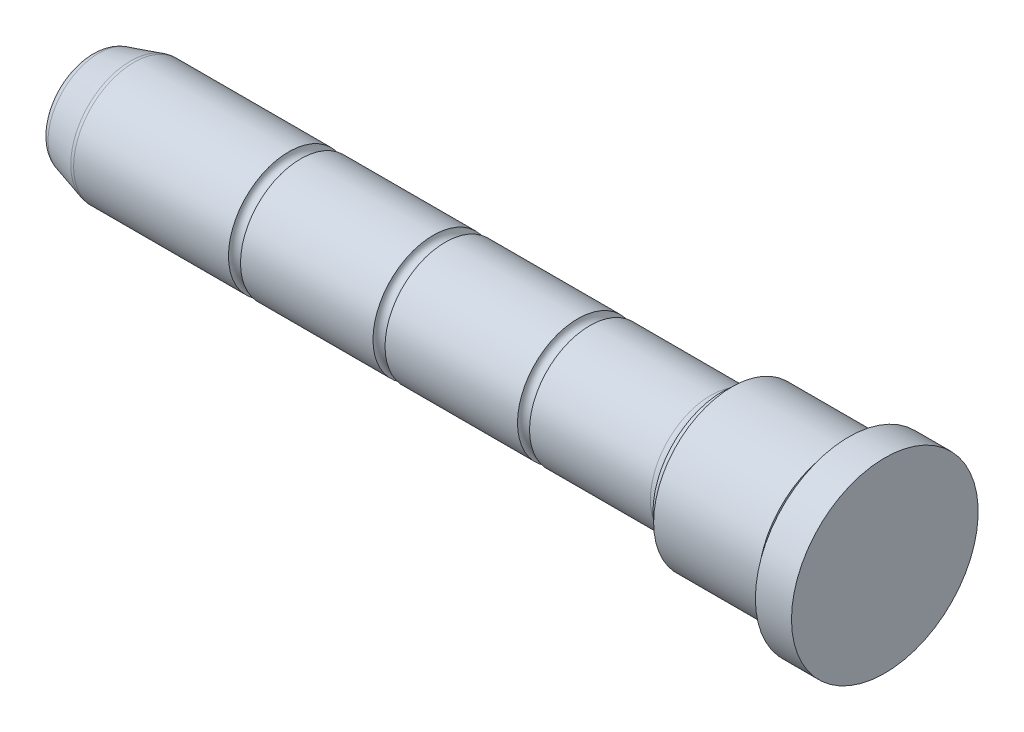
ISO-10303-21;
HEADER;
FILE_DESCRIPTION(('STEP AP214'),'2;1');
FILE_NAME('part.step','',(''),(''),'','','');
FILE_SCHEMA(('AUTOMOTIVE_DESIGN { 1 0 10303 214 1 1 1 1 }'));
ENDSEC;
DATA;
#1=APPLICATION_CONTEXT('core data for automotive mechanical design processes');
#2=APPLICATION_PROTOCOL_DEFINITION('international standard','automotive_design',2000,#1);
#3=PRODUCT_CONTEXT('',#1,'mechanical');
#4=PRODUCT('Part','Part','',(#3));
#5=PRODUCT_RELATED_PRODUCT_CATEGORY('part','',(#4));
#6=PRODUCT_DEFINITION_FORMATION('','',#4);
#7=PRODUCT_DEFINITION_CONTEXT('part definition',#1,'design');
#8=PRODUCT_DEFINITION('design','',#6,#7);
#9=PRODUCT_DEFINITION_SHAPE('','',#8);
#10=(LENGTH_UNIT() NAMED_UNIT(*) SI_UNIT(.MILLI.,.METRE.));
#11=(NAMED_UNIT(*) PLANE_ANGLE_UNIT() SI_UNIT($,.RADIAN.));
#12=(NAMED_UNIT(*) SI_UNIT($,.STERADIAN.) SOLID_ANGLE_UNIT());
#13=UNCERTAINTY_MEASURE_WITH_UNIT(LENGTH_MEASURE(1.E-05),#10,'distance_accuracy_value','');
#14=(GEOMETRIC_REPRESENTATION_CONTEXT(3) GLOBAL_UNCERTAINTY_ASSIGNED_CONTEXT((#13)) GLOBAL_UNIT_ASSIGNED_CONTEXT((#10,
#11,#12)) REPRESENTATION_CONTEXT('',''));
#15=CARTESIAN_POINT('',(0.,0.,0.));
#16=DIRECTION('',(0.,0.,1.));
#17=DIRECTION('',(1.,0.,0.));
#18=AXIS2_PLACEMENT_3D('',#15,#16,#17);
#19=CARTESIAN_POINT('',(131.999999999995,15.4999999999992,-3.88578058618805E-13));
#20=DIRECTION('',(-1.,0.,0.));
#21=DIRECTION('',(0.,0.,0.999999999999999));
#22=AXIS2_PLACEMENT_3D('',#19,#20,#21);
#23=PLANE('',#22);
#24=CARTESIAN_POINT('',(132.,-8.39606162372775E-13,-1.73472347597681E-13));
#25=DIRECTION('',(-1.,0.,0.));
#26=DIRECTION('',(0.,0.,0.999999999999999));
#27=AXIS2_PLACEMENT_3D('',#24,#25,#26);
#28=CIRCLE('',#27,15.5);
#29=CARTESIAN_POINT('',(132.,-8.3874573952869E-13,15.4999999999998));
#30=VERTEX_POINT('',#29);
#31=EDGE_CURVE('E65',#30,#30,#28,.T.);
#32=ORIENTED_EDGE('',*,*,#31,.F.);
#33=EDGE_LOOP('',(#32));
#34=FACE_BOUND('',#33,.T.);
#35=ADVANCED_FACE('F43',(#34),#23,.F.);
#36=CARTESIAN_POINT('',(0.,0.,0.));
#37=DIRECTION('',(-1.,0.,0.));
#38=DIRECTION('',(0.,0.,0.999999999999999));
#39=AXIS2_PLACEMENT_3D('',#36,#37,#38);
#40=CYLINDRICAL_SURFACE('',#39,15.5);
#41=CARTESIAN_POINT('',(126.,0.,1.04083408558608E-13));
#42=DIRECTION('',(-1.,0.,0.));
#43=DIRECTION('',(0.,0.,0.999999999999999));
#44=AXIS2_PLACEMENT_3D('',#41,#42,#43);
#45=CIRCLE('',#44,15.5);
#46=CARTESIAN_POINT('',(126.,0.,15.5000000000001));
#47=VERTEX_POINT('',#46);
#48=EDGE_CURVE('E68',#47,#47,#45,.T.);
#49=ORIENTED_EDGE('',*,*,#48,.F.);
#50=EDGE_LOOP('',(#49));
#51=FACE_BOUND('',#50,.T.);
#52=ORIENTED_EDGE('',*,*,#31,.T.);
#53=EDGE_LOOP('',(#52));
#54=FACE_BOUND('',#53,.T.);
#55=ADVANCED_FACE('F157',(#51,#54),#40,.T.);
#56=CARTESIAN_POINT('',(125.999999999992,13.0000000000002,6.31439345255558E-13));
#57=DIRECTION('',(1.,0.,0.));
#58=DIRECTION('',(0.,0.,-0.999999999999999));
#59=AXIS2_PLACEMENT_3D('',#56,#57,#58);
#60=PLANE('',#59);
#61=CARTESIAN_POINT('',(126.,0.,1.04083408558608E-13));
#62=DIRECTION('',(-1.,0.,0.));
#63=DIRECTION('',(0.,0.,0.999999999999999));
#64=AXIS2_PLACEMENT_3D('',#61,#62,#63);
#65=CIRCLE('',#64,13.);
#66=CARTESIAN_POINT('',(126.,0.,13.0000000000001));
#67=VERTEX_POINT('',#66);
#68=EDGE_CURVE('E71',#67,#67,#65,.T.);
#69=ORIENTED_EDGE('',*,*,#68,.F.);
#70=EDGE_LOOP('',(#69));
#71=FACE_BOUND('',#70,.T.);
#72=ORIENTED_EDGE('',*,*,#48,.T.);
#73=EDGE_LOOP('',(#72));
#74=FACE_BOUND('',#73,.T.);
#75=ADVANCED_FACE('F162',(#71,#74),#60,.F.);
#76=CARTESIAN_POINT('',(125.,0.,1.11022302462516E-13));
#77=DIRECTION('',(-1.,0.,0.));
#78=DIRECTION('',(0.,0.,0.999999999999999));
#79=AXIS2_PLACEMENT_3D('',#76,#77,#78);
#80=TOROIDAL_SURFACE('',#79,13.,1.);
#81=CARTESIAN_POINT('',(125.,0.,1.11022302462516E-13));
#82=DIRECTION('',(-1.,0.,0.));
#83=DIRECTION('',(0.,0.,0.999999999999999));
#84=AXIS2_PLACEMENT_3D('',#81,#82,#83);
#85=CIRCLE('',#84,12.);
#86=CARTESIAN_POINT('',(125.,0.,12.0000000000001));
#87=VERTEX_POINT('',#86);
#88=EDGE_CURVE('E74',#87,#87,#85,.T.);
#89=ORIENTED_EDGE('',*,*,#88,.F.);
#90=EDGE_LOOP('',(#89));
#91=FACE_BOUND('',#90,.T.);
#92=ORIENTED_EDGE('',*,*,#68,.T.);
#93=EDGE_LOOP('',(#92));
#94=FACE_BOUND('',#93,.T.);
#95=ADVANCED_FACE('F169',(#91,#94),#80,.F.);
#96=CARTESIAN_POINT('',(0.,0.,0.));
#97=DIRECTION('',(-1.,0.,0.));
#98=DIRECTION('',(0.,0.,0.999999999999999));
#99=AXIS2_PLACEMENT_3D('',#96,#97,#98);
#100=CYLINDRICAL_SURFACE('',#99,12.);
#101=CARTESIAN_POINT('',(124.5,0.,1.31838984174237E-13));
#102=DIRECTION('',(-1.,0.,0.));
#103=DIRECTION('',(0.,0.,0.999999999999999));
#104=AXIS2_PLACEMENT_3D('',#101,#102,#103);
#105=CIRCLE('',#104,12.);
#106=CARTESIAN_POINT('',(124.5,0.,12.0000000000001));
#107=VERTEX_POINT('',#106);
#108=EDGE_CURVE('E77',#107,#107,#105,.T.);
#109=ORIENTED_EDGE('',*,*,#108,.F.);
#110=EDGE_LOOP('',(#109));
#111=FACE_BOUND('',#110,.T.);
#112=ORIENTED_EDGE('',*,*,#88,.T.);
#113=EDGE_LOOP('',(#112));
#114=FACE_BOUND('',#113,.T.);
#115=ADVANCED_FACE('F176',(#111,#114),#100,.T.);
#116=CARTESIAN_POINT('',(124.5,0.,1.31838984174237E-13));
#117=DIRECTION('',(-1.,0.,0.));
#118=DIRECTION('',(0.,0.,0.999999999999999));
#119=AXIS2_PLACEMENT_3D('',#116,#117,#118);
#120=TOROIDAL_SURFACE('',#119,12.5,0.5);
#121=CARTESIAN_POINT('',(124.,0.,1.04083408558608E-13));
#122=DIRECTION('',(-1.,0.,0.));
#123=DIRECTION('',(0.,0.,0.999999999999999));
#124=AXIS2_PLACEMENT_3D('',#121,#122,#123);
#125=CIRCLE('',#124,12.5);
#126=CARTESIAN_POINT('',(124.,0.,12.5000000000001));
#127=VERTEX_POINT('',#126);
#128=EDGE_CURVE('E80',#127,#127,#125,.T.);
#129=ORIENTED_EDGE('',*,*,#128,.F.);
#130=EDGE_LOOP('',(#129));
#131=FACE_BOUND('',#130,.T.);
#132=ORIENTED_EDGE('',*,*,#108,.T.);
#133=EDGE_LOOP('',(#132));
#134=FACE_BOUND('',#133,.T.);
#135=ADVANCED_FACE('F180',(#131,#134),#120,.F.);
#136=CARTESIAN_POINT('',(124.,13.0000000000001,0.));
#137=DIRECTION('',(-1.,0.,0.));
#138=DIRECTION('',(0.,0.,0.999999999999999));
#139=AXIS2_PLACEMENT_3D('',#136,#137,#138);
#140=PLANE('',#139);
#141=CARTESIAN_POINT('',(124.,0.,1.04083408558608E-13));
#142=DIRECTION('',(-1.,0.,0.));
#143=DIRECTION('',(0.,0.,0.999999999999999));
#144=AXIS2_PLACEMENT_3D('',#141,#142,#143);
#145=CIRCLE('',#144,13.);
#146=CARTESIAN_POINT('',(124.,0.,13.0000000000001));
#147=VERTEX_POINT('',#146);
#148=EDGE_CURVE('E83',#147,#147,#145,.T.);
#149=ORIENTED_EDGE('',*,*,#148,.F.);
#150=EDGE_LOOP('',(#149));
#151=FACE_BOUND('',#150,.T.);
#152=ORIENTED_EDGE('',*,*,#128,.T.);
#153=EDGE_LOOP('',(#152));
#154=FACE_BOUND('',#153,.T.);
#155=ADVANCED_FACE('F184',(#151,#154),#140,.F.);
#156=CARTESIAN_POINT('',(0.,0.,0.));
#157=DIRECTION('',(-1.,0.,0.));
#158=DIRECTION('',(0.,0.,0.999999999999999));
#159=AXIS2_PLACEMENT_3D('',#156,#157,#158);
#160=CYLINDRICAL_SURFACE('',#159,13.);
#161=CARTESIAN_POINT('',(106.603912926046,-1.66533453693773E-13,0.));
#162=DIRECTION('',(-1.,0.,0.));
#163=DIRECTION('',(0.,0.,0.999999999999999));
#164=AXIS2_PLACEMENT_3D('',#161,#162,#163);
#165=CIRCLE('',#164,13.);
#166=CARTESIAN_POINT('',(106.603912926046,-1.65811808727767E-13,12.9999999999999));
#167=VERTEX_POINT('',#166);
#168=EDGE_CURVE('E86',#167,#167,#165,.T.);
#169=ORIENTED_EDGE('',*,*,#168,.F.);
#170=EDGE_LOOP('',(#169));
#171=FACE_BOUND('',#170,.T.);
#172=ORIENTED_EDGE('',*,*,#148,.T.);
#173=EDGE_LOOP('',(#172));
#174=FACE_BOUND('',#173,.T.);
#175=ADVANCED_FACE('F188',(#171,#174),#160,.T.);
#176=CARTESIAN_POINT('',(106.603912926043,11.5,-1.73472347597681E-13));
#177=DIRECTION('',(1.,0.,0.));
#178=DIRECTION('',(0.,0.,-0.999999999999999));
#179=AXIS2_PLACEMENT_3D('',#176,#177,#178);
#180=PLANE('',#179);
#181=CARTESIAN_POINT('',(106.603912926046,-1.66533453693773E-13,0.));
#182=DIRECTION('',(-1.,0.,0.));
#183=DIRECTION('',(0.,0.,0.999999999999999));
#184=AXIS2_PLACEMENT_3D('',#181,#182,#183);
#185=CIRCLE('',#184,11.5);
#186=CARTESIAN_POINT('',(106.603912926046,-1.65895075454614E-13,11.4999999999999));
#187=VERTEX_POINT('',#186);
#188=EDGE_CURVE('E89',#187,#187,#185,.T.);
#189=ORIENTED_EDGE('',*,*,#188,.F.);
#190=EDGE_LOOP('',(#189));
#191=FACE_BOUND('',#190,.T.);
#192=ORIENTED_EDGE('',*,*,#168,.T.);
#193=EDGE_LOOP('',(#192));
#194=FACE_BOUND('',#193,.T.);
#195=ADVANCED_FACE('F153',(#191,#194),#180,.F.);
#196=CARTESIAN_POINT('',(0.,0.,0.));
#197=DIRECTION('',(-1.,0.,0.));
#198=DIRECTION('',(0.,0.,0.999999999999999));
#199=AXIS2_PLACEMENT_3D('',#196,#197,#198);
#200=CYLINDRICAL_SURFACE('',#199,11.5);
#201=CARTESIAN_POINT('',(105.,-2.22044604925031E-13,0.));
#202=DIRECTION('',(-1.,0.,0.));
#203=DIRECTION('',(0.,0.,0.999999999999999));
#204=AXIS2_PLACEMENT_3D('',#201,#202,#203);
#205=CIRCLE('',#204,11.5);
#206=CARTESIAN_POINT('',(105.,-2.21406226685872E-13,11.5));
#207=VERTEX_POINT('',#206);
#208=EDGE_CURVE('E92',#207,#207,#205,.T.);
#209=ORIENTED_EDGE('',*,*,#208,.F.);
#210=EDGE_LOOP('',(#209));
#211=FACE_BOUND('',#210,.T.);
#212=ORIENTED_EDGE('',*,*,#188,.T.);
#213=EDGE_LOOP('',(#212));
#214=FACE_BOUND('',#213,.T.);
#215=ADVANCED_FACE('F148',(#211,#214),#200,.T.);
#216=CARTESIAN_POINT('',(0.,0.,0.));
#217=DIRECTION('',(-1.,0.,0.));
#218=DIRECTION('',(0.,0.,0.999999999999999));
#219=AXIS2_PLACEMENT_3D('',#216,#217,#218);
#220=CYLINDRICAL_SURFACE('',#219,10.);
#221=CARTESIAN_POINT('',(103.063508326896,-8.11850586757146E-13,3.81639164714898E-13));
#222=DIRECTION('',(1.,0.,0.));
#223=DIRECTION('',(0.,0.,-0.999999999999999));
#224=AXIS2_PLACEMENT_3D('',#221,#222,#223);
#225=CIRCLE('',#224,10.);
#226=CARTESIAN_POINT('',(103.063508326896,-8.12405698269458E-13,-9.99999999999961));
#227=VERTEX_POINT('',#226);
#228=EDGE_CURVE('E12',#227,#227,#225,.F.);
#229=ORIENTED_EDGE('',*,*,#228,.T.);
#230=EDGE_LOOP('',(#229));
#231=FACE_BOUND('',#230,.T.);
#232=CARTESIAN_POINT('',(83.,-1.88737914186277E-12,4.40619762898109E-12));
#233=DIRECTION('',(-1.,0.,0.));
#234=DIRECTION('',(0.,0.,0.999999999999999));
#235=AXIS2_PLACEMENT_3D('',#232,#233,#234);
#236=CIRCLE('',#235,10.);
#237=CARTESIAN_POINT('',(83.,-1.88682403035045E-12,10.0000000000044));
#238=VERTEX_POINT('',#237);
#239=EDGE_CURVE('E95',#238,#238,#236,.T.);
#240=ORIENTED_EDGE('',*,*,#239,.F.);
#241=EDGE_LOOP('',(#240));
#242=FACE_BOUND('',#241,.T.);
#243=ADVANCED_FACE('F143',(#231,#242),#220,.T.);
#244=CARTESIAN_POINT('',(82.,-2.22044604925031E-13,0.));
#245=DIRECTION('',(-1.,0.,0.));
#246=DIRECTION('',(0.,0.,0.999999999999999));
#247=AXIS2_PLACEMENT_3D('',#244,#245,#246);
#248=TOROIDAL_SURFACE('',#247,10.,1.);
#249=CARTESIAN_POINT('',(81.,-2.4980018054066E-13,-2.56739074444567E-13));
#250=DIRECTION('',(-1.,0.,0.));
#251=DIRECTION('',(0.,0.,0.999999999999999));
#252=AXIS2_PLACEMENT_3D('',#249,#250,#251);
#253=CIRCLE('',#252,10.);
#254=CARTESIAN_POINT('',(81.,-2.49245069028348E-13,9.99999999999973));
#255=VERTEX_POINT('',#254);
#256=EDGE_CURVE('E98',#255,#255,#253,.T.);
#257=ORIENTED_EDGE('',*,*,#256,.F.);
#258=EDGE_LOOP('',(#257));
#259=FACE_BOUND('',#258,.T.);
#260=ORIENTED_EDGE('',*,*,#239,.T.);
#261=EDGE_LOOP('',(#260));
#262=FACE_BOUND('',#261,.T.);
#263=ADVANCED_FACE('F137',(#259,#262),#248,.F.);
#264=CARTESIAN_POINT('',(0.,0.,0.));
#265=DIRECTION('',(-1.,0.,0.));
#266=DIRECTION('',(0.,0.,0.999999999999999));
#267=AXIS2_PLACEMENT_3D('',#264,#265,#266);
#268=CYLINDRICAL_SURFACE('',#267,10.);
#269=CARTESIAN_POINT('',(58.9999999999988,-2.77555756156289E-13,0.));
#270=DIRECTION('',(-1.,0.,0.));
#271=DIRECTION('',(0.,0.,0.999999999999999));
#272=AXIS2_PLACEMENT_3D('',#269,#270,#271);
#273=CIRCLE('',#272,10.);
#274=CARTESIAN_POINT('',(58.9999999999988,-2.77000644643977E-13,9.99999999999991));
#275=VERTEX_POINT('',#274);
#276=EDGE_CURVE('E101',#275,#275,#273,.T.);
#277=ORIENTED_EDGE('',*,*,#276,.F.);
#278=EDGE_LOOP('',(#277));
#279=FACE_BOUND('',#278,.T.);
#280=ORIENTED_EDGE('',*,*,#256,.T.);
#281=EDGE_LOOP('',(#280));
#282=FACE_BOUND('',#281,.T.);
#283=ADVANCED_FACE('F131',(#279,#282),#268,.T.);
#284=CARTESIAN_POINT('',(57.9999999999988,-6.10622663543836E-13,8.2572837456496E-13));
#285=DIRECTION('',(-1.,0.,0.));
#286=DIRECTION('',(0.,0.,0.999999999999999));
#287=AXIS2_PLACEMENT_3D('',#284,#285,#286);
#288=TOROIDAL_SURFACE('',#287,10.,0.999999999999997);
#289=CARTESIAN_POINT('',(56.9999999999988,-7.91033905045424E-13,-2.0122792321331E-13));
#290=DIRECTION('',(-1.,0.,0.));
#291=DIRECTION('',(0.,0.,0.999999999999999));
#292=AXIS2_PLACEMENT_3D('',#289,#290,#291);
#293=CIRCLE('',#292,10.);
#294=CARTESIAN_POINT('',(56.9999999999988,-7.90478793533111E-13,9.99999999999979));
#295=VERTEX_POINT('',#294);
#296=EDGE_CURVE('E104',#295,#295,#293,.T.);
#297=ORIENTED_EDGE('',*,*,#296,.F.);
#298=EDGE_LOOP('',(#297));
#299=FACE_BOUND('',#298,.T.);
#300=ORIENTED_EDGE('',*,*,#276,.T.);
#301=EDGE_LOOP('',(#300));
#302=FACE_BOUND('',#301,.T.);
#303=ADVANCED_FACE('F125',(#299,#302),#288,.F.);
#304=CARTESIAN_POINT('',(0.,0.,0.));
#305=DIRECTION('',(-1.,0.,0.));
#306=DIRECTION('',(0.,0.,0.999999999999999));
#307=AXIS2_PLACEMENT_3D('',#304,#305,#306);
#308=CYLINDRICAL_SURFACE('',#307,10.);
#309=CARTESIAN_POINT('',(34.9999999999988,-2.56739074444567E-13,-3.67761376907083E-13));
#310=DIRECTION('',(-1.,0.,0.));
#311=DIRECTION('',(0.,0.,0.999999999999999));
#312=AXIS2_PLACEMENT_3D('',#309,#310,#311);
#313=CIRCLE('',#312,10.);
#314=CARTESIAN_POINT('',(34.9999999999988,-2.56183962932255E-13,9.99999999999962));
#315=VERTEX_POINT('',#314);
#316=EDGE_CURVE('E107',#315,#315,#313,.T.);
#317=ORIENTED_EDGE('',*,*,#316,.F.);
#318=EDGE_LOOP('',(#317));
#319=FACE_BOUND('',#318,.T.);
#320=ORIENTED_EDGE('',*,*,#296,.T.);
#321=EDGE_LOOP('',(#320));
#322=FACE_BOUND('',#321,.T.);
#323=ADVANCED_FACE('F119',(#319,#322),#308,.T.);
#324=CARTESIAN_POINT('',(33.9999999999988,-4.78783679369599E-13,-3.33066907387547E-13));
#325=DIRECTION('',(-1.,0.,0.));
#326=DIRECTION('',(0.,0.,0.999999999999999));
#327=AXIS2_PLACEMENT_3D('',#324,#325,#326);
#328=TOROIDAL_SURFACE('',#327,10.,1.);
#329=CARTESIAN_POINT('',(32.9999999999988,-9.22872889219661E-13,1.60982338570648E-12));
#330=DIRECTION('',(-1.,0.,0.));
#331=DIRECTION('',(0.,0.,0.999999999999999));
#332=AXIS2_PLACEMENT_3D('',#329,#330,#331);
#333=CIRCLE('',#332,10.);
#334=CARTESIAN_POINT('',(32.9999999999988,-9.22317777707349E-13,10.0000000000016));
#335=VERTEX_POINT('',#334);
#336=EDGE_CURVE('E110',#335,#335,#333,.T.);
#337=ORIENTED_EDGE('',*,*,#336,.F.);
#338=EDGE_LOOP('',(#337));
#339=FACE_BOUND('',#338,.T.);
#340=ORIENTED_EDGE('',*,*,#316,.T.);
#341=EDGE_LOOP('',(#340));
#342=FACE_BOUND('',#341,.T.);
#343=ADVANCED_FACE('F116',(#339,#342),#328,.F.);
#344=CARTESIAN_POINT('',(0.,0.,0.));
#345=DIRECTION('',(-1.,0.,0.));
#346=DIRECTION('',(0.,0.,0.999999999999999));
#347=AXIS2_PLACEMENT_3D('',#344,#345,#346);
#348=CYLINDRICAL_SURFACE('',#347,10.);
#349=CARTESIAN_POINT('',(7.28010988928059,-3.33066907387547E-13,-4.78783679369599E-13));
#350=DIRECTION('',(-1.,0.,0.));
#351=DIRECTION('',(0.,0.,0.999999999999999));
#352=AXIS2_PLACEMENT_3D('',#349,#350,#351);
#353=CIRCLE('',#352,10.);
#354=CARTESIAN_POINT('',(7.28010988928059,-3.32511795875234E-13,9.99999999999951));
#355=VERTEX_POINT('',#354);
#356=EDGE_CURVE('E53',#355,#355,#353,.F.);
#357=ORIENTED_EDGE('',*,*,#356,.T.);
#358=EDGE_LOOP('',(#357));
#359=FACE_BOUND('',#358,.T.);
#360=ORIENTED_EDGE('',*,*,#336,.T.);
#361=EDGE_LOOP('',(#360));
#362=FACE_BOUND('',#361,.T.);
#363=ADVANCED_FACE('F114',(#359,#362),#348,.T.);
#364=CARTESIAN_POINT('',(0.,0.,0.));
#365=DIRECTION('',(1.,0.,0.));
#366=DIRECTION('',(0.,0.,-0.999999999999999));
#367=AXIS2_PLACEMENT_3D('',#364,#365,#366);
#368=PLANE('',#367);
#369=CARTESIAN_POINT('',(0.,0.,0.));
#370=DIRECTION('',(1.,0.,0.));
#371=DIRECTION('',(0.,0.,-0.999999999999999));
#372=AXIS2_PLACEMENT_3D('',#369,#370,#371);
#373=CIRCLE('',#372,6.49139717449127);
#374=CARTESIAN_POINT('',(0.,0.,-6.49139717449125));
#375=VERTEX_POINT('',#374);
#376=EDGE_CURVE('E62',#375,#375,#373,.F.);
#377=ORIENTED_EDGE('',*,*,#376,.T.);
#378=EDGE_LOOP('',(#377));
#379=FACE_BOUND('',#378,.T.);
#380=ADVANCED_FACE('F247',(#379),#368,.F.);
#381=CARTESIAN_POINT('',(0.,0.,0.));
#382=DIRECTION('',(1.,0.,0.));
#383=DIRECTION('',(0.,0.,-0.999999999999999));
#384=AXIS2_PLACEMENT_3D('',#381,#382,#383);
#385=CONICAL_SURFACE('',#384,8.,0.278299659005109);
#386=CARTESIAN_POINT('',(6.73066763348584,-4.57966997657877E-13,-1.94289029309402E-13));
#387=DIRECTION('',(1.,0.,0.));
#388=DIRECTION('',(0.,0.,-0.999999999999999));
#389=AXIS2_PLACEMENT_3D('',#386,#387,#388);
#390=CIRCLE('',#389,9.92304789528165);
#391=CARTESIAN_POINT('',(6.73066763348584,-4.58517837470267E-13,-9.92304789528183));
#392=VERTEX_POINT('',#391);
#393=EDGE_CURVE('E49',#392,#392,#390,.F.);
#394=ORIENTED_EDGE('',*,*,#393,.T.);
#395=EDGE_LOOP('',(#394));
#396=FACE_BOUND('',#395,.T.);
#397=CARTESIAN_POINT('',(1.45055774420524,-1.88737914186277E-12,-7.28583859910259E-13));
#398=DIRECTION('',(1.,0.,0.));
#399=DIRECTION('',(0.,0.,-0.999999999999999));
#400=AXIS2_PLACEMENT_3D('',#397,#398,#399);
#401=CIRCLE('',#400,8.41444506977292);
#402=CARTESIAN_POINT('',(1.45055774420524,-1.88784623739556E-12,-8.41444506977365));
#403=VERTEX_POINT('',#402);
#404=EDGE_CURVE('E57',#403,#403,#401,.T.);
#405=ORIENTED_EDGE('',*,*,#404,.T.);
#406=EDGE_LOOP('',(#405));
#407=FACE_BOUND('',#406,.T.);
#408=ADVANCED_FACE('F255',(#396,#407),#385,.T.);
#409=CARTESIAN_POINT('',(2.,-2.81719092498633E-12,2.55351295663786E-12));
#410=DIRECTION('',(1.,0.,0.));
#411=DIRECTION('',(0.,0.,-0.999999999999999));
#412=AXIS2_PLACEMENT_3D('',#409,#410,#411);
#413=TOROIDAL_SURFACE('',#412,6.49139717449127,2.);
#414=ORIENTED_EDGE('',*,*,#404,.F.);
#415=EDGE_LOOP('',(#414));
#416=FACE_BOUND('',#415,.T.);
#417=ORIENTED_EDGE('',*,*,#376,.F.);
#418=EDGE_LOOP('',(#417));
#419=FACE_BOUND('',#418,.T.);
#420=ADVANCED_FACE('F263',(#416,#419),#413,.T.);
#421=CARTESIAN_POINT('',(7.28010988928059,-3.33066907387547E-13,-4.78783679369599E-13));
#422=DIRECTION('',(-1.,0.,0.));
#423=DIRECTION('',(0.,0.,0.999999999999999));
#424=AXIS2_PLACEMENT_3D('',#421,#422,#423);
#425=TOROIDAL_SURFACE('',#424,8.,2.);
#426=ORIENTED_EDGE('',*,*,#393,.F.);
#427=EDGE_LOOP('',(#426));
#428=FACE_BOUND('',#427,.T.);
#429=ORIENTED_EDGE('',*,*,#356,.F.);
#430=EDGE_LOOP('',(#429));
#431=FACE_BOUND('',#430,.T.);
#432=ADVANCED_FACE('F270',(#428,#431),#425,.T.);
#433=CARTESIAN_POINT('',(103.063508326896,-8.11850586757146E-13,3.81639164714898E-13));
#434=DIRECTION('',(1.,0.,0.));
#435=DIRECTION('',(0.,0.,-0.999999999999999));
#436=AXIS2_PLACEMENT_3D('',#433,#434,#435);
#437=TOROIDAL_SURFACE('',#436,12.,2.);
#438=ORIENTED_EDGE('',*,*,#208,.T.);
#439=EDGE_LOOP('',(#438));
#440=FACE_BOUND('',#439,.T.);
#441=ORIENTED_EDGE('',*,*,#228,.F.);
#442=EDGE_LOOP('',(#441));
#443=FACE_BOUND('',#442,.T.);
#444=ADVANCED_FACE('F278',(#440,#443),#437,.F.);
#445=CLOSED_SHELL('',(#35,#55,#75,#95,#115,#135,#155,#175,#195,#215,#243,#263,#283,#303,#323,
#343,#363,#380,#408,#420,#432,#444));
#446=MANIFOLD_SOLID_BREP('B2',#445);
#447=ADVANCED_BREP_SHAPE_REPRESENTATION('',(#18,#446),#14);
#448=SHAPE_DEFINITION_REPRESENTATION(#9,#447);
ENDSEC;
END-ISO-10303-21;
